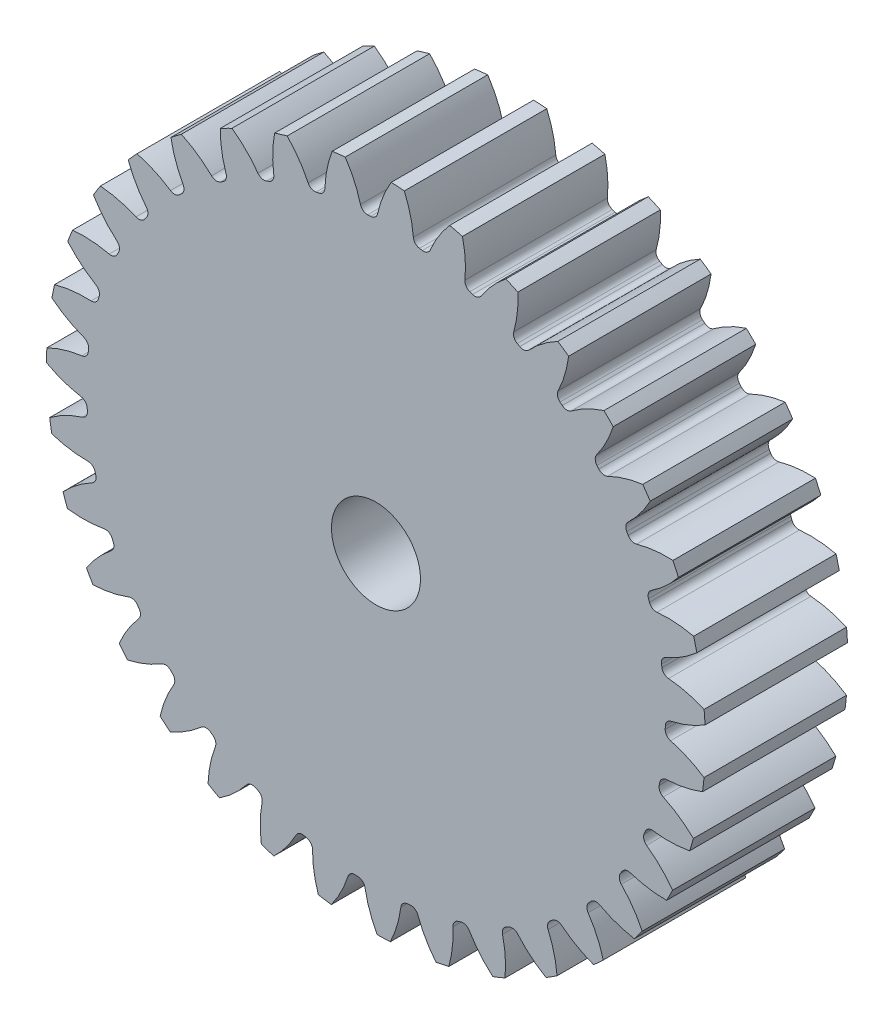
from build123d import *

# Parameters (mm, degrees)
SKETCH3_R         = 234.95
GEARBODY_DEPTH    = 101.6
TOOTHCUT_DEPTH    = 348.455846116
CIRPATTERN1_COUNT = 35
BOREDIA_R         = 31.75
BORE_DEPTH        = 12700


with BuildPart() as part:
    # Sketch3 → gearBody (new body)
    with BuildSketch(Plane.XY):
        Circle(SKETCH3_R)
    extrude(amount=GEARBODY_DEPTH)

    # Sketch2 → toothCut (cut, through all)
    with BuildSketch(Plane.XY):
        with BuildLine():
            ThreePointArc((206.303367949, -5.437002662), (206.328158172, -4.396790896), (206.347703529, -3.356467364))
            ThreePointArc((206.347703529, -3.356467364), (207.509618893, -0.174484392), (210.392223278, 1.604744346))
            ThreePointArc((210.392223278, 1.604744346), (223.084783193, 5.560054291), (234.95, 11.556902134))
            ThreePointArc((234.95, 11.556902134), (235.1806711, -5.011629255), (234.244389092, -21.555293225))
            ThreePointArc((234.244389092, -21.555293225), (222.645409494, -15.058430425), (210.132868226, -10.566007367))
            ThreePointArc((210.132868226, -10.566007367), (207.32867589, -8.665594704), (206.303367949, -5.437002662))
        make_face()
    toothcut = extrude(amount=TOOTHCUT_DEPTH, mode=Mode.SUBTRACT)

    # CirPattern1: toothCut ×35 about axis
    cirpattern1_axis = Axis((0, 0, 0), (0, 0, 1))
    for i in range(1, CIRPATTERN1_COUNT):
        add(toothcut.rotate(cirpattern1_axis, i * 360 / CIRPATTERN1_COUNT), mode=Mode.SUBTRACT)

    # boreDia → bore (cut, symmetric)
    with BuildSketch(Plane.XY):
        Circle(BOREDIA_R)
    extrude(amount=BORE_DEPTH, both=True, mode=Mode.SUBTRACT)


solid = part.part
